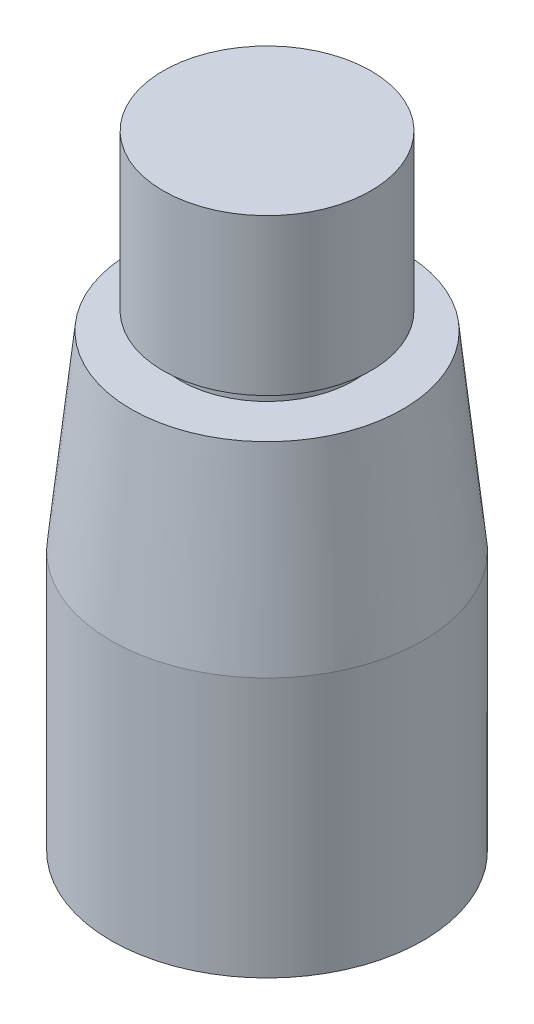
ISO-10303-21;
HEADER;
FILE_DESCRIPTION(('STEP AP214'),'2;1');
FILE_NAME('part.step','',(''),(''),'','','');
FILE_SCHEMA(('AUTOMOTIVE_DESIGN { 1 0 10303 214 1 1 1 1 }'));
ENDSEC;
DATA;
#1=APPLICATION_CONTEXT('core data for automotive mechanical design processes');
#2=APPLICATION_PROTOCOL_DEFINITION('international standard','automotive_design',2000,#1);
#3=PRODUCT_CONTEXT('',#1,'mechanical');
#4=PRODUCT('Part','Part','',(#3));
#5=PRODUCT_RELATED_PRODUCT_CATEGORY('part','',(#4));
#6=PRODUCT_DEFINITION_FORMATION('','',#4);
#7=PRODUCT_DEFINITION_CONTEXT('part definition',#1,'design');
#8=PRODUCT_DEFINITION('design','',#6,#7);
#9=PRODUCT_DEFINITION_SHAPE('','',#8);
#10=(LENGTH_UNIT() NAMED_UNIT(*) SI_UNIT(.MILLI.,.METRE.));
#11=(NAMED_UNIT(*) PLANE_ANGLE_UNIT() SI_UNIT($,.RADIAN.));
#12=(NAMED_UNIT(*) SI_UNIT($,.STERADIAN.) SOLID_ANGLE_UNIT());
#13=UNCERTAINTY_MEASURE_WITH_UNIT(LENGTH_MEASURE(1.E-05),#10,'distance_accuracy_value','');
#14=(GEOMETRIC_REPRESENTATION_CONTEXT(3) GLOBAL_UNCERTAINTY_ASSIGNED_CONTEXT((#13)) GLOBAL_UNIT_ASSIGNED_CONTEXT((#10,
#11,#12)) REPRESENTATION_CONTEXT('',''));
#15=CARTESIAN_POINT('',(0.,0.,0.));
#16=DIRECTION('',(0.,0.,1.));
#17=DIRECTION('',(1.,0.,0.));
#18=AXIS2_PLACEMENT_3D('',#15,#16,#17);
#19=CARTESIAN_POINT('',(0.,0.,0.));
#20=DIRECTION('',(0.,-1.,0.));
#21=DIRECTION('',(0.,0.,-1.));
#22=AXIS2_PLACEMENT_3D('',#19,#20,#21);
#23=PLANE('',#22);
#24=CARTESIAN_POINT('',(0.,0.,0.));
#25=DIRECTION('',(0.,1.,0.));
#26=DIRECTION('',(0.,0.,1.));
#27=AXIS2_PLACEMENT_3D('',#24,#25,#26);
#28=CIRCLE('',#27,9.);
#29=CARTESIAN_POINT('',(0.,0.,9.));
#30=VERTEX_POINT('',#29);
#31=EDGE_CURVE('E10',#30,#30,#28,.T.);
#32=ORIENTED_EDGE('',*,*,#31,.F.);
#33=EDGE_LOOP('',(#32));
#34=FACE_BOUND('',#33,.T.);
#35=ADVANCED_FACE('F30',(#34),#23,.T.);
#36=CARTESIAN_POINT('',(0.,85.1026449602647,0.));
#37=DIRECTION('',(0.,1.,0.));
#38=DIRECTION('',(0.,0.,1.));
#39=AXIS2_PLACEMENT_3D('',#36,#37,#38);
#40=CYLINDRICAL_SURFACE('',#39,9.);
#41=ORIENTED_EDGE('',*,*,#31,.T.);
#42=EDGE_LOOP('',(#41));
#43=FACE_BOUND('',#42,.T.);
#44=CARTESIAN_POINT('',(0.,15.,0.));
#45=DIRECTION('',(0.,1.,0.));
#46=DIRECTION('',(0.,0.,1.));
#47=AXIS2_PLACEMENT_3D('',#44,#45,#46);
#48=CIRCLE('',#47,9.);
#49=CARTESIAN_POINT('',(0.,15.,9.));
#50=VERTEX_POINT('',#49);
#51=EDGE_CURVE('E36',#50,#50,#48,.T.);
#52=ORIENTED_EDGE('',*,*,#51,.F.);
#53=EDGE_LOOP('',(#52));
#54=FACE_BOUND('',#53,.T.);
#55=ADVANCED_FACE('F75',(#43,#54),#40,.T.);
#56=CARTESIAN_POINT('',(0.,26.,0.));
#57=DIRECTION('',(0.,-1.,0.));
#58=DIRECTION('',(0.,0.,-1.));
#59=AXIS2_PLACEMENT_3D('',#56,#57,#58);
#60=CONICAL_SURFACE('',#59,7.84385341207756,0.10471975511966);
#61=ORIENTED_EDGE('',*,*,#51,.T.);
#62=EDGE_LOOP('',(#61));
#63=FACE_BOUND('',#62,.T.);
#64=CARTESIAN_POINT('',(0.,26.,0.));
#65=DIRECTION('',(0.,1.,0.));
#66=DIRECTION('',(0.,0.,1.));
#67=AXIS2_PLACEMENT_3D('',#64,#65,#66);
#68=CIRCLE('',#67,7.84385341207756);
#69=CARTESIAN_POINT('',(0.,26.,7.84385341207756));
#70=VERTEX_POINT('',#69);
#71=EDGE_CURVE('E40',#70,#70,#68,.T.);
#72=ORIENTED_EDGE('',*,*,#71,.F.);
#73=EDGE_LOOP('',(#72));
#74=FACE_BOUND('',#73,.T.);
#75=ADVANCED_FACE('F80',(#63,#74),#60,.T.);
#76=CARTESIAN_POINT('',(-7.84385341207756,26.,0.));
#77=DIRECTION('',(0.,1.,0.));
#78=DIRECTION('',(0.,0.,1.));
#79=AXIS2_PLACEMENT_3D('',#76,#77,#78);
#80=PLANE('',#79);
#81=ORIENTED_EDGE('',*,*,#71,.T.);
#82=EDGE_LOOP('',(#81));
#83=FACE_BOUND('',#82,.T.);
#84=CARTESIAN_POINT('',(0.,26.,0.));
#85=DIRECTION('',(0.,1.,0.));
#86=DIRECTION('',(0.,0.,1.));
#87=AXIS2_PLACEMENT_3D('',#84,#85,#86);
#88=CIRCLE('',#87,5.);
#89=CARTESIAN_POINT('',(0.,26.,5.));
#90=VERTEX_POINT('',#89);
#91=EDGE_CURVE('E44',#90,#90,#88,.T.);
#92=ORIENTED_EDGE('',*,*,#91,.F.);
#93=EDGE_LOOP('',(#92));
#94=FACE_BOUND('',#93,.T.);
#95=ADVANCED_FACE('F84',(#83,#94),#80,.T.);
#96=CARTESIAN_POINT('',(0.,85.1026449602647,0.));
#97=DIRECTION('',(0.,1.,0.));
#98=DIRECTION('',(0.,0.,1.));
#99=AXIS2_PLACEMENT_3D('',#96,#97,#98);
#100=CYLINDRICAL_SURFACE('',#99,5.);
#101=ORIENTED_EDGE('',*,*,#91,.T.);
#102=EDGE_LOOP('',(#101));
#103=FACE_BOUND('',#102,.T.);
#104=CARTESIAN_POINT('',(0.,27.,0.));
#105=DIRECTION('',(0.,1.,0.));
#106=DIRECTION('',(0.,0.,1.));
#107=AXIS2_PLACEMENT_3D('',#104,#105,#106);
#108=CIRCLE('',#107,5.);
#109=CARTESIAN_POINT('',(0.,27.,5.));
#110=VERTEX_POINT('',#109);
#111=EDGE_CURVE('E49',#110,#110,#108,.T.);
#112=ORIENTED_EDGE('',*,*,#111,.F.);
#113=EDGE_LOOP('',(#112));
#114=FACE_BOUND('',#113,.T.);
#115=ADVANCED_FACE('F71',(#103,#114),#100,.T.);
#116=CARTESIAN_POINT('',(-5.,27.,0.));
#117=DIRECTION('',(0.,-1.,0.));
#118=DIRECTION('',(0.,0.,-1.));
#119=AXIS2_PLACEMENT_3D('',#116,#117,#118);
#120=PLANE('',#119);
#121=ORIENTED_EDGE('',*,*,#111,.T.);
#122=EDGE_LOOP('',(#121));
#123=FACE_BOUND('',#122,.T.);
#124=CARTESIAN_POINT('',(0.,27.,0.));
#125=DIRECTION('',(0.,1.,0.));
#126=DIRECTION('',(0.,0.,1.));
#127=AXIS2_PLACEMENT_3D('',#124,#125,#126);
#128=CIRCLE('',#127,6.);
#129=CARTESIAN_POINT('',(0.,27.,6.));
#130=VERTEX_POINT('',#129);
#131=EDGE_CURVE('E52',#130,#130,#128,.T.);
#132=ORIENTED_EDGE('',*,*,#131,.F.);
#133=EDGE_LOOP('',(#132));
#134=FACE_BOUND('',#133,.T.);
#135=ADVANCED_FACE('F63',(#123,#134),#120,.T.);
#136=CARTESIAN_POINT('',(0.,85.1026449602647,0.));
#137=DIRECTION('',(0.,1.,0.));
#138=DIRECTION('',(0.,0.,1.));
#139=AXIS2_PLACEMENT_3D('',#136,#137,#138);
#140=CYLINDRICAL_SURFACE('',#139,6.);
#141=ORIENTED_EDGE('',*,*,#131,.T.);
#142=EDGE_LOOP('',(#141));
#143=FACE_BOUND('',#142,.T.);
#144=CARTESIAN_POINT('',(0.,36.,0.));
#145=DIRECTION('',(0.,1.,0.));
#146=DIRECTION('',(0.,0.,1.));
#147=AXIS2_PLACEMENT_3D('',#144,#145,#146);
#148=CIRCLE('',#147,6.);
#149=CARTESIAN_POINT('',(0.,36.,6.));
#150=VERTEX_POINT('',#149);
#151=EDGE_CURVE('E55',#150,#150,#148,.T.);
#152=ORIENTED_EDGE('',*,*,#151,.F.);
#153=EDGE_LOOP('',(#152));
#154=FACE_BOUND('',#153,.T.);
#155=ADVANCED_FACE('F61',(#143,#154),#140,.T.);
#156=CARTESIAN_POINT('',(-6.,36.,0.));
#157=DIRECTION('',(0.,1.,0.));
#158=DIRECTION('',(0.,0.,1.));
#159=AXIS2_PLACEMENT_3D('',#156,#157,#158);
#160=PLANE('',#159);
#161=ORIENTED_EDGE('',*,*,#151,.T.);
#162=EDGE_LOOP('',(#161));
#163=FACE_BOUND('',#162,.T.);
#164=ADVANCED_FACE('F59',(#163),#160,.T.);
#165=CLOSED_SHELL('',(#35,#55,#75,#95,#115,#135,#155,#164));
#166=MANIFOLD_SOLID_BREP('B2',#165);
#167=ADVANCED_BREP_SHAPE_REPRESENTATION('',(#18,#166),#14);
#168=SHAPE_DEFINITION_REPRESENTATION(#9,#167);
ENDSEC;
END-ISO-10303-21;
